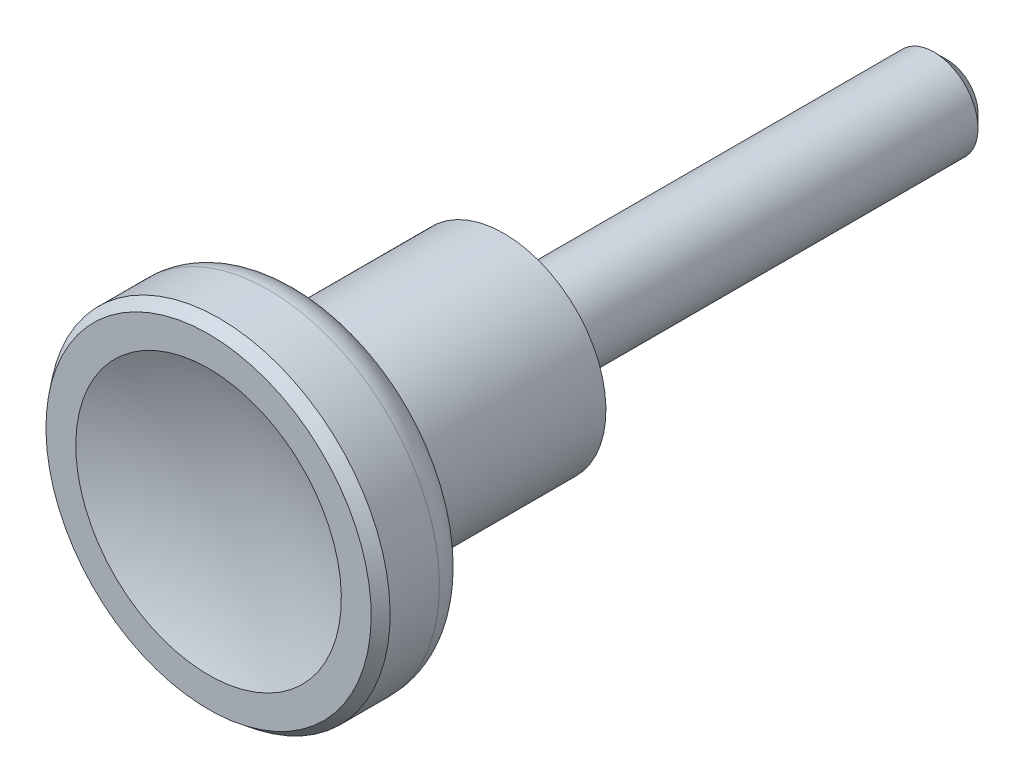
ISO-10303-21;
HEADER;
FILE_DESCRIPTION(('STEP AP214'),'2;1');
FILE_NAME('part.step','',(''),(''),'','','');
FILE_SCHEMA(('AUTOMOTIVE_DESIGN { 1 0 10303 214 1 1 1 1 }'));
ENDSEC;
DATA;
#1=APPLICATION_CONTEXT('core data for automotive mechanical design processes');
#2=APPLICATION_PROTOCOL_DEFINITION('international standard','automotive_design',2000,#1);
#3=PRODUCT_CONTEXT('',#1,'mechanical');
#4=PRODUCT('Part','Part','',(#3));
#5=PRODUCT_RELATED_PRODUCT_CATEGORY('part','',(#4));
#6=PRODUCT_DEFINITION_FORMATION('','',#4);
#7=PRODUCT_DEFINITION_CONTEXT('part definition',#1,'design');
#8=PRODUCT_DEFINITION('design','',#6,#7);
#9=PRODUCT_DEFINITION_SHAPE('','',#8);
#10=(LENGTH_UNIT() NAMED_UNIT(*) SI_UNIT(.MILLI.,.METRE.));
#11=(NAMED_UNIT(*) PLANE_ANGLE_UNIT() SI_UNIT($,.RADIAN.));
#12=(NAMED_UNIT(*) SI_UNIT($,.STERADIAN.) SOLID_ANGLE_UNIT());
#13=UNCERTAINTY_MEASURE_WITH_UNIT(LENGTH_MEASURE(1.E-05),#10,'distance_accuracy_value','');
#14=(GEOMETRIC_REPRESENTATION_CONTEXT(3) GLOBAL_UNCERTAINTY_ASSIGNED_CONTEXT((#13)) GLOBAL_UNIT_ASSIGNED_CONTEXT((#10,
#11,#12)) REPRESENTATION_CONTEXT('',''));
#15=CARTESIAN_POINT('',(0.,0.,0.));
#16=DIRECTION('',(0.,0.,1.));
#17=DIRECTION('',(1.,0.,0.));
#18=AXIS2_PLACEMENT_3D('',#15,#16,#17);
#19=CARTESIAN_POINT('',(9.25,0.,0.2));
#20=DIRECTION('',(0.,0.,1.));
#21=DIRECTION('',(0.,-1.,0.));
#22=AXIS2_PLACEMENT_3D('',#19,#20,#21);
#23=PLANE('',#22);
#24=CARTESIAN_POINT('',(0.,0.,0.2));
#25=DIRECTION('',(0.,0.,-1.));
#26=DIRECTION('',(0.,1.,0.));
#27=AXIS2_PLACEMENT_3D('',#24,#25,#26);
#28=CIRCLE('',#27,5.);
#29=CARTESIAN_POINT('',(0.,5.,0.2));
#30=VERTEX_POINT('',#29);
#31=EDGE_CURVE('E56',#30,#30,#28,.T.);
#32=ORIENTED_EDGE('',*,*,#31,.F.);
#33=EDGE_LOOP('',(#32));
#34=FACE_BOUND('',#33,.T.);
#35=CARTESIAN_POINT('',(0.,0.,0.2));
#36=DIRECTION('',(0.,0.,-1.));
#37=DIRECTION('',(0.,1.,0.));
#38=AXIS2_PLACEMENT_3D('',#35,#36,#37);
#39=CIRCLE('',#38,9.25);
#40=CARTESIAN_POINT('',(0.,9.25,0.2));
#41=VERTEX_POINT('',#40);
#42=EDGE_CURVE('E23',#41,#41,#39,.T.);
#43=ORIENTED_EDGE('',*,*,#42,.T.);
#44=EDGE_LOOP('',(#43));
#45=FACE_BOUND('',#44,.T.);
#46=ADVANCED_FACE('F12',(#34,#45),#23,.F.);
#47=CARTESIAN_POINT('',(0.,0.,-4.9324732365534));
#48=DIRECTION('',(0.,0.,-1.));
#49=DIRECTION('',(0.,1.,0.));
#50=AXIS2_PLACEMENT_3D('',#47,#48,#49);
#51=CYLINDRICAL_SURFACE('',#50,9.25);
#52=CARTESIAN_POINT('',(0.,0.,17.));
#53=DIRECTION('',(0.,0.,-1.));
#54=DIRECTION('',(0.,1.,0.));
#55=AXIS2_PLACEMENT_3D('',#52,#53,#54);
#56=CIRCLE('',#55,9.25);
#57=CARTESIAN_POINT('',(0.,9.25,17.));
#58=VERTEX_POINT('',#57);
#59=EDGE_CURVE('E27',#58,#58,#56,.T.);
#60=ORIENTED_EDGE('',*,*,#59,.T.);
#61=EDGE_LOOP('',(#60));
#62=FACE_BOUND('',#61,.T.);
#63=ORIENTED_EDGE('',*,*,#42,.F.);
#64=EDGE_LOOP('',(#63));
#65=FACE_BOUND('',#64,.T.);
#66=ADVANCED_FACE('F64',(#62,#65),#51,.T.);
#67=CARTESIAN_POINT('',(0.,0.,17.));
#68=DIRECTION('',(0.,0.,-1.));
#69=DIRECTION('',(0.,1.,0.));
#70=AXIS2_PLACEMENT_3D('',#67,#68,#69);
#71=TOROIDAL_SURFACE('',#70,10.0070026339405,0.757002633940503);
#72=ORIENTED_EDGE('',*,*,#59,.F.);
#73=EDGE_LOOP('',(#72));
#74=FACE_BOUND('',#73,.T.);
#75=CARTESIAN_POINT('',(0.,0.,17.7312080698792));
#76=DIRECTION('',(0.,0.,-1.));
#77=DIRECTION('',(0.,1.,0.));
#78=AXIS2_PLACEMENT_3D('',#75,#76,#77);
#79=CIRCLE('',#78,9.81107472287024);
#80=CARTESIAN_POINT('',(0.,9.81107472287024,17.7312080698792));
#81=VERTEX_POINT('',#80);
#82=EDGE_CURVE('E32',#81,#81,#79,.T.);
#83=ORIENTED_EDGE('',*,*,#82,.T.);
#84=EDGE_LOOP('',(#83));
#85=FACE_BOUND('',#84,.T.);
#86=ADVANCED_FACE('F68',(#74,#85),#71,.F.);
#87=CARTESIAN_POINT('',(0.,0.,17.7312080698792));
#88=DIRECTION('',(0.,0.,1.));
#89=DIRECTION('',(0.,-1.,0.));
#90=AXIS2_PLACEMENT_3D('',#87,#88,#89);
#91=CONICAL_SURFACE('',#90,9.81107472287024,1.30899528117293);
#92=CARTESIAN_POINT('',(0.,0.,18.6597619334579));
#93=DIRECTION('',(0.,0.,-1.));
#94=DIRECTION('',(0.,1.,0.));
#95=AXIS2_PLACEMENT_3D('',#92,#93,#94);
#96=CIRCLE('',#95,13.2764619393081);
#97=CARTESIAN_POINT('',(0.,13.2764619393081,18.6597619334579));
#98=VERTEX_POINT('',#97);
#99=EDGE_CURVE('E35',#98,#98,#96,.T.);
#100=ORIENTED_EDGE('',*,*,#99,.T.);
#101=EDGE_LOOP('',(#100));
#102=FACE_BOUND('',#101,.T.);
#103=ORIENTED_EDGE('',*,*,#82,.F.);
#104=EDGE_LOOP('',(#103));
#105=FACE_BOUND('',#104,.T.);
#106=ADVANCED_FACE('F76',(#102,#105),#91,.T.);
#107=CARTESIAN_POINT('',(0.,0.,21.5575381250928));
#108=DIRECTION('',(0.,0.,-1.));
#109=DIRECTION('',(0.,1.,0.));
#110=AXIS2_PLACEMENT_3D('',#107,#108,#109);
#111=TOROIDAL_SURFACE('',#110,12.5,3.);
#112=CARTESIAN_POINT('',(0.,0.,21.5575381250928));
#113=DIRECTION('',(0.,0.,-1.));
#114=DIRECTION('',(0.,1.,0.));
#115=AXIS2_PLACEMENT_3D('',#112,#113,#114);
#116=CIRCLE('',#115,15.5);
#117=CARTESIAN_POINT('',(0.,15.5,21.5575381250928));
#118=VERTEX_POINT('',#117);
#119=EDGE_CURVE('E38',#118,#118,#116,.T.);
#120=ORIENTED_EDGE('',*,*,#119,.T.);
#121=EDGE_LOOP('',(#120));
#122=FACE_BOUND('',#121,.T.);
#123=ORIENTED_EDGE('',*,*,#99,.F.);
#124=EDGE_LOOP('',(#123));
#125=FACE_BOUND('',#124,.T.);
#126=ADVANCED_FACE('F82',(#122,#125),#111,.T.);
#127=CARTESIAN_POINT('',(0.,0.,-4.9324732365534));
#128=DIRECTION('',(0.,0.,-1.));
#129=DIRECTION('',(0.,1.,0.));
#130=AXIS2_PLACEMENT_3D('',#127,#128,#129);
#131=CYLINDRICAL_SURFACE('',#130,15.5);
#132=CARTESIAN_POINT('',(0.,0.,26.0301314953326));
#133=DIRECTION('',(0.,0.,-1.));
#134=DIRECTION('',(0.,1.,0.));
#135=AXIS2_PLACEMENT_3D('',#132,#133,#134);
#136=CIRCLE('',#135,15.5);
#137=CARTESIAN_POINT('',(0.,15.5,26.0301314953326));
#138=VERTEX_POINT('',#137);
#139=EDGE_CURVE('E41',#138,#138,#136,.T.);
#140=ORIENTED_EDGE('',*,*,#139,.T.);
#141=EDGE_LOOP('',(#140));
#142=FACE_BOUND('',#141,.T.);
#143=ORIENTED_EDGE('',*,*,#119,.F.);
#144=EDGE_LOOP('',(#143));
#145=FACE_BOUND('',#144,.T.);
#146=ADVANCED_FACE('F86',(#142,#145),#131,.T.);
#147=CARTESIAN_POINT('',(0.,0.,27.));
#148=DIRECTION('',(0.,0.,-1.));
#149=DIRECTION('',(0.,1.,0.));
#150=AXIS2_PLACEMENT_3D('',#147,#148,#149);
#151=CONICAL_SURFACE('',#150,14.7507565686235,0.657759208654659);
#152=ORIENTED_EDGE('',*,*,#139,.F.);
#153=EDGE_LOOP('',(#152));
#154=FACE_BOUND('',#153,.T.);
#155=CARTESIAN_POINT('',(0.,0.,27.));
#156=DIRECTION('',(0.,0.,-1.));
#157=DIRECTION('',(0.,1.,0.));
#158=AXIS2_PLACEMENT_3D('',#155,#156,#157);
#159=CIRCLE('',#158,14.7507565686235);
#160=CARTESIAN_POINT('',(0.,14.7507565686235,27.));
#161=VERTEX_POINT('',#160);
#162=EDGE_CURVE('E44',#161,#161,#159,.T.);
#163=ORIENTED_EDGE('',*,*,#162,.T.);
#164=EDGE_LOOP('',(#163));
#165=FACE_BOUND('',#164,.T.);
#166=ADVANCED_FACE('F90',(#154,#165),#151,.T.);
#167=CARTESIAN_POINT('',(14.7507565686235,0.,27.));
#168=DIRECTION('',(0.,0.,1.));
#169=DIRECTION('',(0.,-1.,0.));
#170=AXIS2_PLACEMENT_3D('',#167,#168,#169);
#171=PLANE('',#170);
#172=CARTESIAN_POINT('',(0.,0.,27.));
#173=DIRECTION('',(0.,0.,-1.));
#174=DIRECTION('',(0.,1.,0.));
#175=AXIS2_PLACEMENT_3D('',#172,#173,#174);
#176=CIRCLE('',#175,12.0457822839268);
#177=CARTESIAN_POINT('',(0.,12.0457822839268,27.));
#178=VERTEX_POINT('',#177);
#179=EDGE_CURVE('E47',#178,#178,#176,.T.);
#180=ORIENTED_EDGE('',*,*,#179,.T.);
#181=EDGE_LOOP('',(#180));
#182=FACE_BOUND('',#181,.T.);
#183=ORIENTED_EDGE('',*,*,#162,.F.);
#184=EDGE_LOOP('',(#183));
#185=FACE_BOUND('',#184,.T.);
#186=ADVANCED_FACE('F94',(#182,#185),#171,.T.);
#187=CARTESIAN_POINT('',(0.,0.,54.5624551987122));
#188=DIRECTION('',(0.,-1.,0.));
#189=DIRECTION('',(1.,0.,0.));
#190=AXIS2_PLACEMENT_3D('',#187,#188,#189);
#191=SPHERICAL_SURFACE('',#190,30.0797241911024);
#192=CARTESIAN_POINT('',(0.,0.,54.5624551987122));
#193=DIRECTION('',(0.,0.,-1.));
#194=DIRECTION('',(0.,1.,0.));
#195=AXIS2_PLACEMENT_3D('',#192,#193,#194);
#196=SPHERICAL_SURFACE('',#195,30.0797241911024);
#197=ORIENTED_EDGE('',*,*,#179,.F.);
#198=EDGE_LOOP('',(#197));
#199=FACE_BOUND('',#198,.T.);
#200=ADVANCED_FACE('F98',(#199),#196,.F.);
#201=CARTESIAN_POINT('',(4.,0.,-40.));
#202=DIRECTION('',(0.,0.,1.));
#203=DIRECTION('',(0.,-1.,0.));
#204=AXIS2_PLACEMENT_3D('',#201,#202,#203);
#205=PLANE('',#204);
#206=CARTESIAN_POINT('',(0.,0.,-40.));
#207=DIRECTION('',(0.,0.,1.));
#208=DIRECTION('',(1.,0.,0.));
#209=AXIS2_PLACEMENT_3D('',#206,#207,#208);
#210=CIRCLE('',#209,2.8);
#211=CARTESIAN_POINT('',(2.8,0.,-40.));
#212=VERTEX_POINT('',#211);
#213=EDGE_CURVE('E19',#212,#212,#210,.F.);
#214=ORIENTED_EDGE('',*,*,#213,.T.);
#215=EDGE_LOOP('',(#214));
#216=FACE_BOUND('',#215,.T.);
#217=ADVANCED_FACE('F102',(#216),#205,.F.);
#218=CARTESIAN_POINT('',(0.,0.,-4.9324732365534));
#219=DIRECTION('',(0.,0.,-1.));
#220=DIRECTION('',(0.,1.,0.));
#221=AXIS2_PLACEMENT_3D('',#218,#219,#220);
#222=CYLINDRICAL_SURFACE('',#221,4.);
#223=CARTESIAN_POINT('',(0.,0.,-38.8));
#224=DIRECTION('',(0.,0.,1.));
#225=DIRECTION('',(1.,0.,0.));
#226=AXIS2_PLACEMENT_3D('',#223,#224,#225);
#227=CIRCLE('',#226,4.);
#228=CARTESIAN_POINT('',(4.,0.,-38.8));
#229=VERTEX_POINT('',#228);
#230=EDGE_CURVE('E8',#229,#229,#227,.T.);
#231=ORIENTED_EDGE('',*,*,#230,.T.);
#232=EDGE_LOOP('',(#231));
#233=FACE_BOUND('',#232,.T.);
#234=CARTESIAN_POINT('',(0.,0.,0.));
#235=DIRECTION('',(0.,0.,-1.));
#236=DIRECTION('',(0.,1.,0.));
#237=AXIS2_PLACEMENT_3D('',#234,#235,#236);
#238=CIRCLE('',#237,4.);
#239=CARTESIAN_POINT('',(0.,4.,0.));
#240=VERTEX_POINT('',#239);
#241=EDGE_CURVE('E50',#240,#240,#238,.T.);
#242=ORIENTED_EDGE('',*,*,#241,.T.);
#243=EDGE_LOOP('',(#242));
#244=FACE_BOUND('',#243,.T.);
#245=ADVANCED_FACE('F106',(#233,#244),#222,.T.);
#246=CARTESIAN_POINT('',(4.99999999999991,0.,0.));
#247=DIRECTION('',(0.,0.,1.));
#248=DIRECTION('',(0.,-1.,0.));
#249=AXIS2_PLACEMENT_3D('',#246,#247,#248);
#250=PLANE('',#249);
#251=ORIENTED_EDGE('',*,*,#241,.F.);
#252=EDGE_LOOP('',(#251));
#253=FACE_BOUND('',#252,.T.);
#254=CARTESIAN_POINT('',(0.,0.,0.));
#255=DIRECTION('',(0.,0.,-1.));
#256=DIRECTION('',(0.,1.,0.));
#257=AXIS2_PLACEMENT_3D('',#254,#255,#256);
#258=CIRCLE('',#257,5.);
#259=CARTESIAN_POINT('',(0.,5.,0.));
#260=VERTEX_POINT('',#259);
#261=EDGE_CURVE('E53',#260,#260,#258,.T.);
#262=ORIENTED_EDGE('',*,*,#261,.T.);
#263=EDGE_LOOP('',(#262));
#264=FACE_BOUND('',#263,.T.);
#265=ADVANCED_FACE('F109',(#253,#264),#250,.F.);
#266=CARTESIAN_POINT('',(0.,0.,-4.9324732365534));
#267=DIRECTION('',(0.,0.,-1.));
#268=DIRECTION('',(0.,1.,0.));
#269=AXIS2_PLACEMENT_3D('',#266,#267,#268);
#270=CYLINDRICAL_SURFACE('',#269,5.);
#271=ORIENTED_EDGE('',*,*,#261,.F.);
#272=EDGE_LOOP('',(#271));
#273=FACE_BOUND('',#272,.T.);
#274=ORIENTED_EDGE('',*,*,#31,.T.);
#275=EDGE_LOOP('',(#274));
#276=FACE_BOUND('',#275,.T.);
#277=ADVANCED_FACE('F60',(#273,#276),#270,.T.);
#278=CARTESIAN_POINT('',(0.,0.,-40.));
#279=DIRECTION('',(0.,0.,1.));
#280=DIRECTION('',(1.,0.,0.));
#281=AXIS2_PLACEMENT_3D('',#278,#279,#280);
#282=CONICAL_SURFACE('',#281,2.8,0.785398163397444);
#283=ORIENTED_EDGE('',*,*,#230,.F.);
#284=EDGE_LOOP('',(#283));
#285=FACE_BOUND('',#284,.T.);
#286=ORIENTED_EDGE('',*,*,#213,.F.);
#287=EDGE_LOOP('',(#286));
#288=FACE_BOUND('',#287,.T.);
#289=ADVANCED_FACE('F14',(#285,#288),#282,.T.);
#290=CLOSED_SHELL('',(#46,#66,#86,#106,#126,#146,#166,#186,#200,#217,#245,#265,#277,#289));
#291=MANIFOLD_SOLID_BREP('B1',#290);
#292=ADVANCED_BREP_SHAPE_REPRESENTATION('',(#18,#291),#14);
#293=SHAPE_DEFINITION_REPRESENTATION(#9,#292);
ENDSEC;
END-ISO-10303-21;
